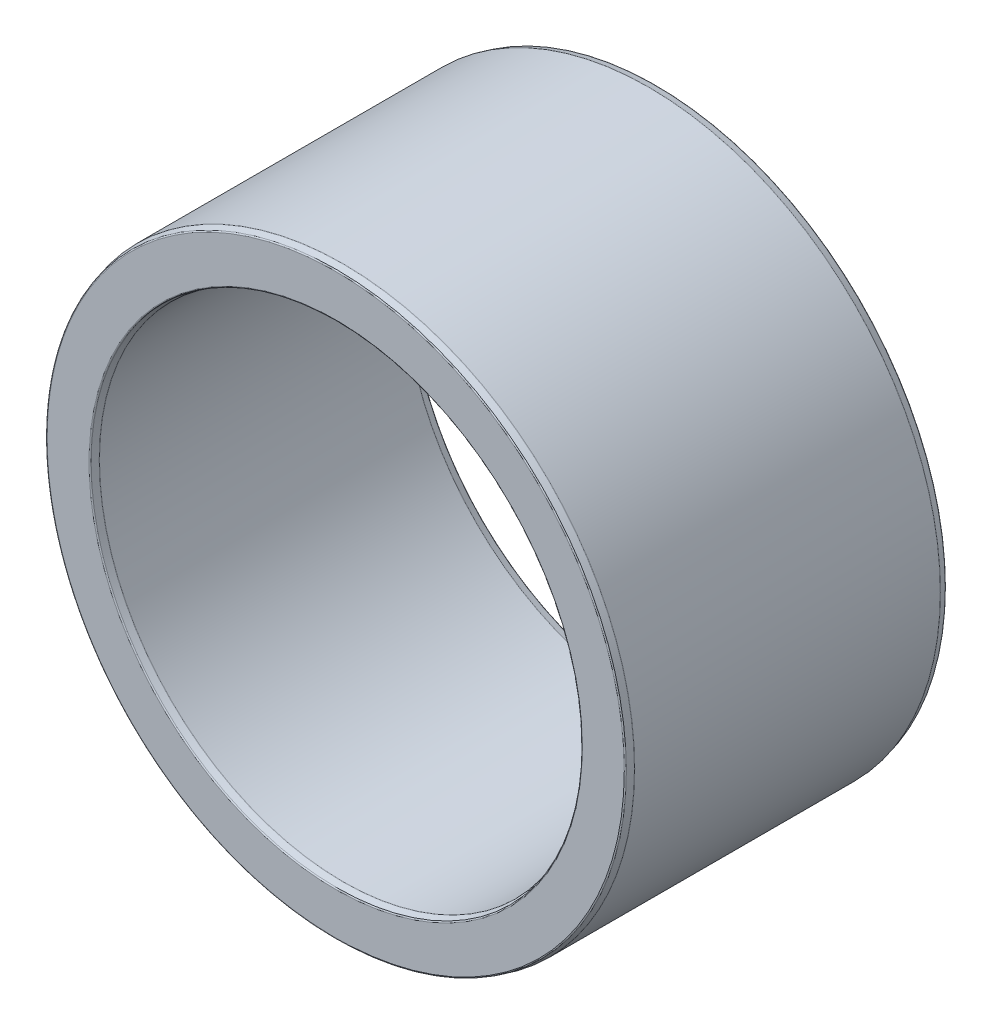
from build123d import *
from OCP.BRepFilletAPI import BRepFilletAPI_MakeChamfer

# Parameters (mm, degrees)
SKETCH1_R           = 30
SKETCH1_R_2         = 25.085
BOSS_EXTRUDE1_DEPTH = 16.4973
CHAMFER1_SIZE       = 0.762
CHAMFER1_SIZE2      = 0.204177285
FILLET1_R           = 0.127


with BuildPart() as part:
    # Sketch1 → Boss-Extrude1 (new, symmetric)
    with BuildSketch(Plane.XY):
        Circle(SKETCH1_R)
        Circle(SKETCH1_R_2, mode=Mode.SUBTRACT)
    extrude(amount=BOSS_EXTRUDE1_DEPTH, both=True)

    # Chamfer1: one chamfer whose edges measure the first distance from different faces: ONE call of the kernel's chamfer builder (chamfer() names one face for all edges)
    chamfer1_edges_1 = [part.edges().sort_by_distance(p)[0] for p in [
        (-30, 0, -16.4973),
        (-30, 0, 16.4973),
    ]]
    chamfer1_side_1 = [part.faces().sort_by_distance(p)[0] for p in [
        (-30, 0, 0),
    ]]
    chamfer1_edges_2 = [part.edges().sort_by_distance(p)[0] for p in [
        (-25.085, 0, -16.4973),
        (-25.085, 0, 16.4973),
    ]]
    chamfer1_side_2 = [part.faces().sort_by_distance(p)[0] for p in [
        (-25.085, 0, 0),
    ]]
    chamfer1 = BRepFilletAPI_MakeChamfer(part.part.solid().wrapped)
    for e in chamfer1_edges_1:
        chamfer1.Add(CHAMFER1_SIZE, CHAMFER1_SIZE2, e.wrapped, chamfer1_side_1[0].wrapped)  # the first distance lies on this face
    for e in chamfer1_edges_2:
        chamfer1.Add(CHAMFER1_SIZE, CHAMFER1_SIZE2, e.wrapped, chamfer1_side_2[0].wrapped)  # the first distance lies on this face
    add(Compound.cast(chamfer1.Shape()), mode=Mode.REPLACE)

    # Fillet1
    fillet1_edges = [part.edges().sort_by_distance(p)[0] for p in [
        (-25.085, 0, 15.7353),
        (-29.795822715, 0, 16.4973),
        (-25.289177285, 0, 16.4973),
        (-30, 0, 15.7353),
        (-30, 0, -15.7353),
        (-25.289177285, 0, -16.4973),
        (-29.795822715, 0, -16.4973),
        (-25.085, 0, -15.7353),
    ]]
    fillet(fillet1_edges, radius=FILLET1_R)


solid = part.part
